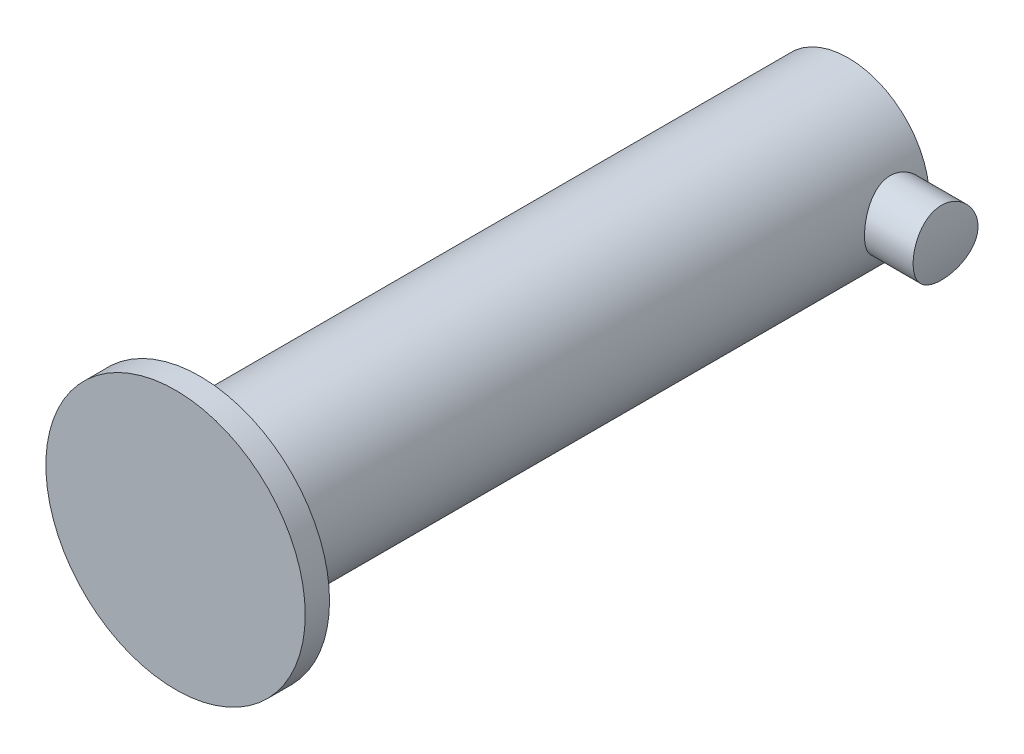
from build123d import *

# Parameters (mm, degrees)
ESQUISSE1_R             = 1
BOSS_EXTRU_1_DEPTH      = 8
ESQUISSE2_R             = 1.6
BOSS_EXTRU_2_DEPTH      = 0.3
ESQUISSE3_R             = 0.4
BOSS_EXTRU_3_DEPTH      = 1.6
ESQUISSE4_R             = 2.121713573
ESQUISSE4_R_2           = 1.6
ENL_V_MAT_EXTRU_1_DEPTH = 1.6
ESQUISSE5_R             = 0.7
ENL_V_MAT_EXTRU_2_DEPTH = 8


with BuildPart() as part:
    # Esquisse1 → Boss.-Extru.1 (new body)
    with BuildSketch(Plane.XY):
        Circle(ESQUISSE1_R)
    extrude(amount=BOSS_EXTRU_1_DEPTH)

    # Esquisse2 → Boss.-Extru.2 (add)
    with BuildSketch(Plane.XY.offset(8)):
        Circle(ESQUISSE2_R)
    extrude(amount=BOSS_EXTRU_2_DEPTH)

    # Esquisse3 → Boss.-Extru.3 (add)
    with BuildSketch(Plane(origin=(0, 0, 0), x_dir=(0, 0, -1), z_dir=(1, 0, 0))):
        with Locations((-0.4, 0)):
            Circle(ESQUISSE3_R)
    extrude(amount=BOSS_EXTRU_3_DEPTH)

    # Esquisse4 → Enl_v. mat.-Extru.1 (cut)
    with BuildSketch(Plane(origin=(0, 0, 0), x_dir=(-1, 0, 0), z_dir=(0, 0, -1))):
        Circle(ESQUISSE4_R)
        with Locations(Location((0, 0, 0), (0, 0, 180))):
            Circle(ESQUISSE4_R_2, mode=Mode.SUBTRACT)
    extrude(amount=-ENL_V_MAT_EXTRU_1_DEPTH, mode=Mode.SUBTRACT)

    # Esquisse5 → Enl_v. mat.-Extru.2 (cut)
    with BuildSketch(Plane(origin=(0, 0, 0), x_dir=(-1, 0, 0), z_dir=(0, 0, -1))):
        Circle(ESQUISSE5_R)
    extrude(amount=-ENL_V_MAT_EXTRU_2_DEPTH, mode=Mode.SUBTRACT)


solid = part.part
